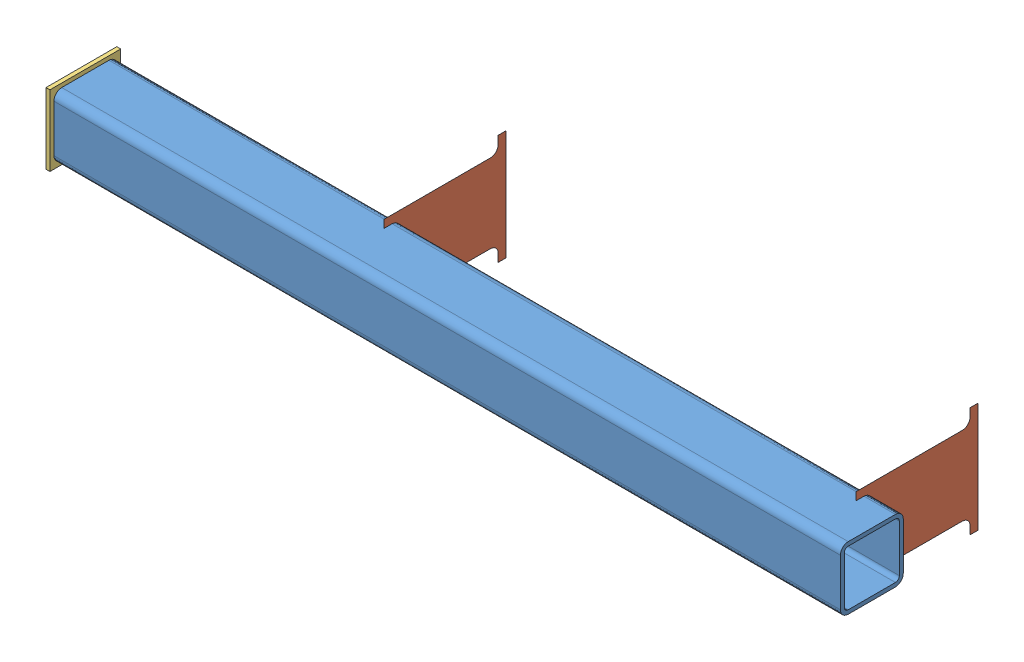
SolidWorks assembly TUBE.SLDASM, configuration Default (file format 4400). Lengths in mm.
Overall size (1276.35 177.8 279.4).
4 component instances, 3 part files, 6 mates.
Components (placement in the parent):
- SQUARE TUBE-1: SQUARE TUBE.SLDPRT [Default<As Machined>] at origin size (1270 101.6 101.6)
- plate-1: plate.sldprt [Default] at origin size (0 177.8 196.85)
- plate-3: plate.sldprt [Default] at (406.4 0 0) x (-1 0 0) z (0 0 1) size (0 177.8 196.85)
- eplate-1: eplate.SLDPRT [Default] at (-635 0 0) x (0 1 0) z (-1 0 0) size (114.3 114.3 6.35)
Mates (geometry in assembly coordinates):
- Coincident2: coincident: plane of SQUARE TUBE-1 through (635 -38.1 -50.8) normal (0 0 -1); line of plate-3 through (-177.8 -38.1 -50.8) axis (0 1 0)
- Distance2: distance = 762 mm anti-aligned: plane of plate-1 through (584.2 38.1 -38.1) normal (1 0 0); plane of plate-3 through (-177.8 -38.1 -38.1) normal (-1 0 0)
- Coincident5: coincident: plane of SQUARE TUBE-1 through (635 -50.8 -38.1) normal (0 -1 0); line of plate-3 through (-177.8 -50.8 -25.4) axis (0 0 -1)
- Coincident6: coincident anti-aligned: plane of SQUARE TUBE-1 through (-635 38.1 38.1) normal (-1 0 0); plane of eplate-1 through (-635 57.15 57.15) normal (1 0 0)
- Distance3: distance = 6.35 mm aligned: plane of eplate-1 through (-641.35 -57.15 -57.15) normal (0 0 -1); plane of SQUARE TUBE-1 through (635 -38.1 -50.8) normal (0 0 -1)
- Distance4: distance = 6.35 mm aligned: plane of ? through (635 50.8 38.1) normal (0 1 0); plane of eplate-1 through (-641.35 57.15 -57.15) normal (0 1 0)
